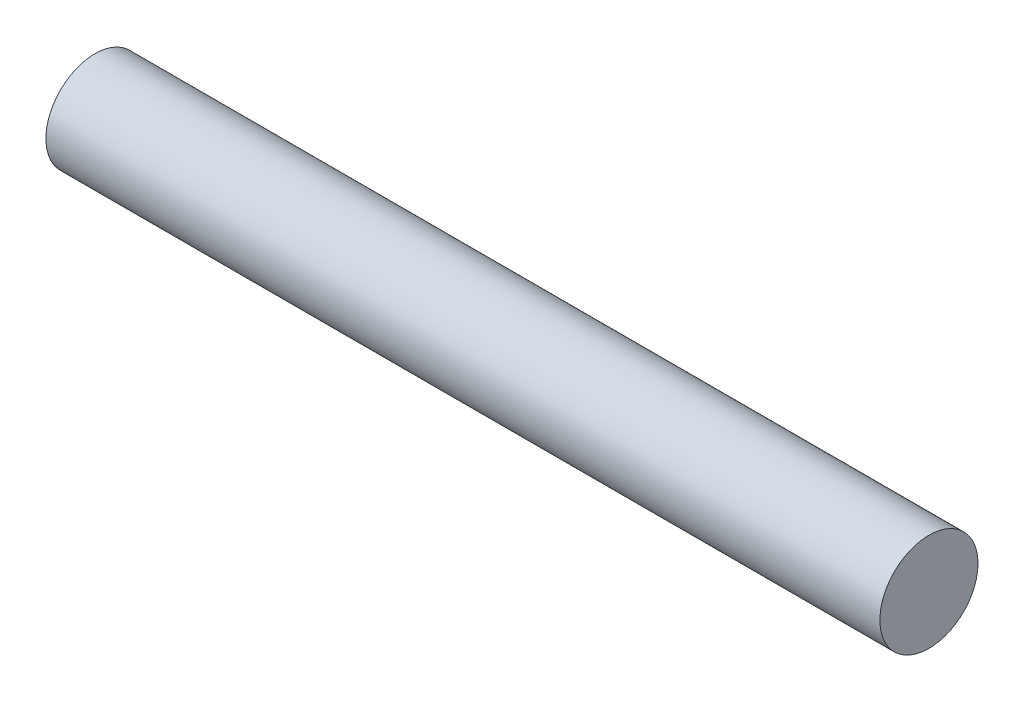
from build123d import *

# Parameters (mm, degrees)
SKETCH1_R           = 12.7
BOSS_EXTRUDE1_DEPTH = 215.9


with BuildPart() as part:
    # Sketch1 → Boss-Extrude1 (new body)
    with BuildSketch(Plane(origin=(0, 0, 0), x_dir=(0, 0, -1), z_dir=(1, 0, 0))):
        Circle(SKETCH1_R)
    extrude(amount=BOSS_EXTRUDE1_DEPTH)


solid = part.part
